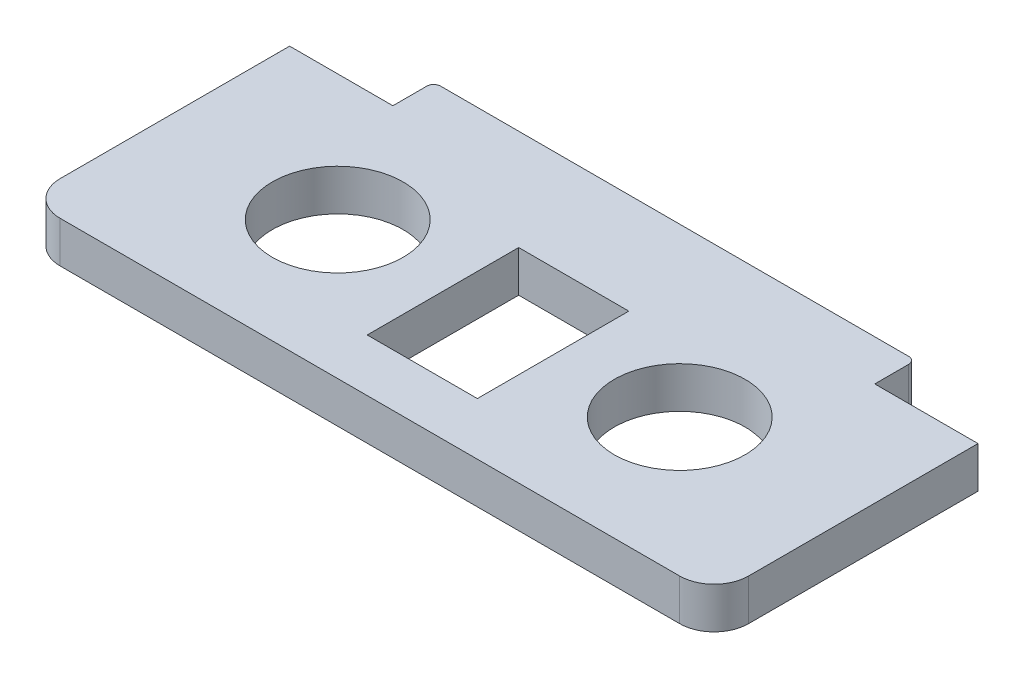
ISO-10303-21;
HEADER;
FILE_DESCRIPTION(('STEP AP214'),'2;1');
FILE_NAME('part.step','',(''),(''),'','','');
FILE_SCHEMA(('AUTOMOTIVE_DESIGN { 1 0 10303 214 1 1 1 1 }'));
ENDSEC;
DATA;
#1=APPLICATION_CONTEXT('core data for automotive mechanical design processes');
#2=APPLICATION_PROTOCOL_DEFINITION('international standard','automotive_design',2000,#1);
#3=PRODUCT_CONTEXT('',#1,'mechanical');
#4=PRODUCT('Part','Part','',(#3));
#5=PRODUCT_RELATED_PRODUCT_CATEGORY('part','',(#4));
#6=PRODUCT_DEFINITION_FORMATION('','',#4);
#7=PRODUCT_DEFINITION_CONTEXT('part definition',#1,'design');
#8=PRODUCT_DEFINITION('design','',#6,#7);
#9=PRODUCT_DEFINITION_SHAPE('','',#8);
#10=(LENGTH_UNIT() NAMED_UNIT(*) SI_UNIT(.MILLI.,.METRE.));
#11=(NAMED_UNIT(*) PLANE_ANGLE_UNIT() SI_UNIT($,.RADIAN.));
#12=(NAMED_UNIT(*) SI_UNIT($,.STERADIAN.) SOLID_ANGLE_UNIT());
#13=UNCERTAINTY_MEASURE_WITH_UNIT(LENGTH_MEASURE(1.E-05),#10,'distance_accuracy_value','');
#14=(GEOMETRIC_REPRESENTATION_CONTEXT(3) GLOBAL_UNCERTAINTY_ASSIGNED_CONTEXT((#13)) GLOBAL_UNIT_ASSIGNED_CONTEXT((#10,
#11,#12)) REPRESENTATION_CONTEXT('',''));
#15=CARTESIAN_POINT('',(0.,0.,0.));
#16=DIRECTION('',(0.,0.,1.));
#17=DIRECTION('',(1.,0.,0.));
#18=AXIS2_PLACEMENT_3D('',#15,#16,#17);
#19=CARTESIAN_POINT('',(0.,6.,0.));
#20=DIRECTION('',(0.,1.,0.));
#21=DIRECTION('',(0.,0.,1.));
#22=AXIS2_PLACEMENT_3D('',#19,#20,#21);
#23=PLANE('',#22);
#24=CARTESIAN_POINT('',(-24.68,6.,0.));
#25=DIRECTION('',(0.,1.,0.));
#26=DIRECTION('',(0.,0.,1.));
#27=AXIS2_PLACEMENT_3D('',#24,#25,#26);
#28=CIRCLE('',#27,9.5);
#29=CARTESIAN_POINT('',(-24.68,6.,9.5));
#30=VERTEX_POINT('',#29);
#31=EDGE_CURVE('E222',#30,#30,#28,.T.);
#32=ORIENTED_EDGE('',*,*,#31,.F.);
#33=EDGE_LOOP('',(#32));
#34=FACE_BOUND('',#33,.T.);
#35=DIRECTION('',(0.,0.,-1.));
#36=VECTOR('',#35,1.);
#37=CARTESIAN_POINT('',(35.,6.,-24.2659470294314));
#38=LINE('',#37,#36);
#39=CARTESIAN_POINT('',(35.,6.,-18.3320340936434));
#40=VERTEX_POINT('',#39);
#41=CARTESIAN_POINT('',(35.,6.,-23.2659470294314));
#42=VERTEX_POINT('',#41);
#43=EDGE_CURVE('E237',#40,#42,#38,.T.);
#44=ORIENTED_EDGE('',*,*,#43,.T.);
#45=CARTESIAN_POINT('',(34.,6.,-23.2659470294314));
#46=DIRECTION('',(0.,1.,0.));
#47=DIRECTION('',(0.,0.,1.));
#48=AXIS2_PLACEMENT_3D('',#45,#46,#47);
#49=CIRCLE('',#48,1.);
#50=CARTESIAN_POINT('',(34.,6.,-24.2659470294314));
#51=VERTEX_POINT('',#50);
#52=EDGE_CURVE('E52',#42,#51,#49,.T.);
#53=ORIENTED_EDGE('',*,*,#52,.T.);
#54=DIRECTION('',(-1.,0.,0.));
#55=VECTOR('',#54,1.);
#56=CARTESIAN_POINT('',(-35.,6.,-24.2659470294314));
#57=LINE('',#56,#55);
#58=CARTESIAN_POINT('',(-34.,6.,-24.2659470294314));
#59=VERTEX_POINT('',#58);
#60=EDGE_CURVE('E240',#51,#59,#57,.T.);
#61=ORIENTED_EDGE('',*,*,#60,.T.);
#62=CARTESIAN_POINT('',(-34.,6.,-23.2659470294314));
#63=DIRECTION('',(0.,1.,0.));
#64=DIRECTION('',(0.,0.,1.));
#65=AXIS2_PLACEMENT_3D('',#62,#63,#64);
#66=CIRCLE('',#65,1.);
#67=CARTESIAN_POINT('',(-35.,6.,-23.2659470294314));
#68=VERTEX_POINT('',#67);
#69=EDGE_CURVE('E59',#59,#68,#66,.T.);
#70=ORIENTED_EDGE('',*,*,#69,.T.);
#71=DIRECTION('',(0.,0.,1.));
#72=VECTOR('',#71,1.);
#73=CARTESIAN_POINT('',(-35.,6.,-18.3320340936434));
#74=LINE('',#73,#72);
#75=CARTESIAN_POINT('',(-35.,6.,-18.3320340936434));
#76=VERTEX_POINT('',#75);
#77=EDGE_CURVE('E243',#68,#76,#74,.T.);
#78=ORIENTED_EDGE('',*,*,#77,.T.);
#79=DIRECTION('',(-1.,0.,0.));
#80=VECTOR('',#79,1.);
#81=CARTESIAN_POINT('',(-50.,6.,-18.3320340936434));
#82=LINE('',#81,#80);
#83=CARTESIAN_POINT('',(-50.,6.,-18.3320340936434));
#84=VERTEX_POINT('',#83);
#85=EDGE_CURVE('E246',#76,#84,#82,.T.);
#86=ORIENTED_EDGE('',*,*,#85,.T.);
#87=DIRECTION('',(0.,0.,1.));
#88=VECTOR('',#87,1.);
#89=CARTESIAN_POINT('',(-50.,6.,-14.));
#90=LINE('',#89,#88);
#91=CARTESIAN_POINT('',(-50.,6.,15.));
#92=VERTEX_POINT('',#91);
#93=EDGE_CURVE('E249',#84,#92,#90,.T.);
#94=ORIENTED_EDGE('',*,*,#93,.T.);
#95=CARTESIAN_POINT('',(-45.,6.,15.));
#96=DIRECTION('',(0.,1.,0.));
#97=DIRECTION('',(0.,0.,1.));
#98=AXIS2_PLACEMENT_3D('',#95,#96,#97);
#99=CIRCLE('',#98,5.);
#100=CARTESIAN_POINT('',(-45.,6.,20.));
#101=VERTEX_POINT('',#100);
#102=EDGE_CURVE('E316',#92,#101,#99,.T.);
#103=ORIENTED_EDGE('',*,*,#102,.T.);
#104=DIRECTION('',(1.,0.,0.));
#105=VECTOR('',#104,1.);
#106=CARTESIAN_POINT('',(-50.,6.,20.));
#107=LINE('',#106,#105);
#108=CARTESIAN_POINT('',(45.,6.,20.));
#109=VERTEX_POINT('',#108);
#110=EDGE_CURVE('E253',#101,#109,#107,.T.);
#111=ORIENTED_EDGE('',*,*,#110,.T.);
#112=CARTESIAN_POINT('',(45.,6.,15.));
#113=DIRECTION('',(0.,1.,0.));
#114=DIRECTION('',(0.,0.,1.));
#115=AXIS2_PLACEMENT_3D('',#112,#113,#114);
#116=CIRCLE('',#115,5.);
#117=CARTESIAN_POINT('',(50.,6.,15.));
#118=VERTEX_POINT('',#117);
#119=EDGE_CURVE('E319',#109,#118,#116,.T.);
#120=ORIENTED_EDGE('',*,*,#119,.T.);
#121=DIRECTION('',(0.,0.,-1.));
#122=VECTOR('',#121,1.);
#123=CARTESIAN_POINT('',(50.,6.,-14.));
#124=LINE('',#123,#122);
#125=CARTESIAN_POINT('',(50.,6.,-18.3320340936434));
#126=VERTEX_POINT('',#125);
#127=EDGE_CURVE('E230',#118,#126,#124,.T.);
#128=ORIENTED_EDGE('',*,*,#127,.T.);
#129=DIRECTION('',(-1.,0.,0.));
#130=VECTOR('',#129,1.);
#131=CARTESIAN_POINT('',(35.,6.,-18.3320340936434));
#132=LINE('',#131,#130);
#133=EDGE_CURVE('E233',#126,#40,#132,.T.);
#134=ORIENTED_EDGE('',*,*,#133,.T.);
#135=EDGE_LOOP('',(#44,#53,#61,#70,#78,#86,#94,#103,#111,#120,#128,#134));
#136=FACE_BOUND('',#135,.T.);
#137=CARTESIAN_POINT('',(25.,6.,0.));
#138=DIRECTION('',(0.,1.,0.));
#139=DIRECTION('',(0.,0.,1.));
#140=AXIS2_PLACEMENT_3D('',#137,#138,#139);
#141=CIRCLE('',#140,9.5);
#142=CARTESIAN_POINT('',(25.,6.,9.5));
#143=VERTEX_POINT('',#142);
#144=EDGE_CURVE('E214',#143,#143,#141,.T.);
#145=ORIENTED_EDGE('',*,*,#144,.F.);
#146=EDGE_LOOP('',(#145));
#147=FACE_BOUND('',#146,.T.);
#148=DIRECTION('',(1.,0.,0.));
#149=VECTOR('',#148,1.);
#150=CARTESIAN_POINT('',(7.97828894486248,6.,12.3708315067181));
#151=LINE('',#150,#149);
#152=CARTESIAN_POINT('',(-8.02171105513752,6.,12.3708315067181));
#153=VERTEX_POINT('',#152);
#154=CARTESIAN_POINT('',(7.97828894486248,6.,12.3708315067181));
#155=VERTEX_POINT('',#154);
#156=EDGE_CURVE('E172',#153,#155,#151,.T.);
#157=ORIENTED_EDGE('',*,*,#156,.F.);
#158=DIRECTION('',(0.,0.,1.));
#159=VECTOR('',#158,1.);
#160=CARTESIAN_POINT('',(-8.02171105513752,6.,12.3708315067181));
#161=LINE('',#160,#159);
#162=CARTESIAN_POINT('',(-8.02171105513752,6.,-9.62916849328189));
#163=VERTEX_POINT('',#162);
#164=EDGE_CURVE('E161',#163,#153,#161,.T.);
#165=ORIENTED_EDGE('',*,*,#164,.F.);
#166=DIRECTION('',(-1.,0.,0.));
#167=VECTOR('',#166,1.);
#168=CARTESIAN_POINT('',(-8.02171105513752,6.,-9.62916849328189));
#169=LINE('',#168,#167);
#170=CARTESIAN_POINT('',(7.97828894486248,6.,-9.62916849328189));
#171=VERTEX_POINT('',#170);
#172=EDGE_CURVE('E190',#171,#163,#169,.T.);
#173=ORIENTED_EDGE('',*,*,#172,.F.);
#174=DIRECTION('',(0.,0.,-1.));
#175=VECTOR('',#174,1.);
#176=CARTESIAN_POINT('',(7.97828894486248,6.,-9.62916849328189));
#177=LINE('',#176,#175);
#178=EDGE_CURVE('E186',#155,#171,#177,.T.);
#179=ORIENTED_EDGE('',*,*,#178,.F.);
#180=EDGE_LOOP('',(#157,#165,#173,#179));
#181=FACE_BOUND('',#180,.T.);
#182=ADVANCED_FACE('F43',(#34,#136,#147,#181),#23,.T.);
#183=CARTESIAN_POINT('',(0.,0.,0.));
#184=DIRECTION('',(0.,1.,0.));
#185=DIRECTION('',(0.,0.,1.));
#186=AXIS2_PLACEMENT_3D('',#183,#184,#185);
#187=PLANE('',#186);
#188=CARTESIAN_POINT('',(25.,0.,0.));
#189=DIRECTION('',(0.,1.,0.));
#190=DIRECTION('',(0.,0.,1.));
#191=AXIS2_PLACEMENT_3D('',#188,#189,#190);
#192=CIRCLE('',#191,9.5);
#193=CARTESIAN_POINT('',(25.,0.,9.5));
#194=VERTEX_POINT('',#193);
#195=EDGE_CURVE('E181',#194,#194,#192,.T.);
#196=ORIENTED_EDGE('',*,*,#195,.T.);
#197=EDGE_LOOP('',(#196));
#198=FACE_BOUND('',#197,.T.);
#199=CARTESIAN_POINT('',(-24.68,0.,0.));
#200=DIRECTION('',(0.,1.,0.));
#201=DIRECTION('',(0.,0.,1.));
#202=AXIS2_PLACEMENT_3D('',#199,#200,#201);
#203=CIRCLE('',#202,9.5);
#204=CARTESIAN_POINT('',(-24.68,0.,9.5));
#205=VERTEX_POINT('',#204);
#206=EDGE_CURVE('E218',#205,#205,#203,.T.);
#207=ORIENTED_EDGE('',*,*,#206,.T.);
#208=EDGE_LOOP('',(#207));
#209=FACE_BOUND('',#208,.T.);
#210=DIRECTION('',(-1.,0.,0.));
#211=VECTOR('',#210,1.);
#212=CARTESIAN_POINT('',(-35.,0.,-24.2659470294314));
#213=LINE('',#212,#211);
#214=CARTESIAN_POINT('',(34.,0.,-24.2659470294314));
#215=VERTEX_POINT('',#214);
#216=CARTESIAN_POINT('',(-34.,0.,-24.2659470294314));
#217=VERTEX_POINT('',#216);
#218=EDGE_CURVE('E266',#215,#217,#213,.T.);
#219=ORIENTED_EDGE('',*,*,#218,.F.);
#220=CARTESIAN_POINT('',(34.,0.,-23.2659470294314));
#221=DIRECTION('',(0.,1.,0.));
#222=DIRECTION('',(0.,0.,1.));
#223=AXIS2_PLACEMENT_3D('',#220,#221,#222);
#224=CIRCLE('',#223,1.);
#225=CARTESIAN_POINT('',(35.,0.,-23.2659470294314));
#226=VERTEX_POINT('',#225);
#227=EDGE_CURVE('E335',#215,#226,#224,.F.);
#228=ORIENTED_EDGE('',*,*,#227,.T.);
#229=DIRECTION('',(0.,0.,-1.));
#230=VECTOR('',#229,1.);
#231=CARTESIAN_POINT('',(35.,0.,-24.2659470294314));
#232=LINE('',#231,#230);
#233=CARTESIAN_POINT('',(35.,0.,-18.3320340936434));
#234=VERTEX_POINT('',#233);
#235=EDGE_CURVE('E263',#234,#226,#232,.T.);
#236=ORIENTED_EDGE('',*,*,#235,.F.);
#237=DIRECTION('',(-1.,0.,0.));
#238=VECTOR('',#237,1.);
#239=CARTESIAN_POINT('',(35.,0.,-18.3320340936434));
#240=LINE('',#239,#238);
#241=CARTESIAN_POINT('',(50.,0.,-18.3320340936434));
#242=VERTEX_POINT('',#241);
#243=EDGE_CURVE('E260',#242,#234,#240,.T.);
#244=ORIENTED_EDGE('',*,*,#243,.F.);
#245=DIRECTION('',(0.,0.,-1.));
#246=VECTOR('',#245,1.);
#247=CARTESIAN_POINT('',(50.,0.,-18.3320340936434));
#248=LINE('',#247,#246);
#249=CARTESIAN_POINT('',(50.,0.,15.));
#250=VERTEX_POINT('',#249);
#251=EDGE_CURVE('E226',#250,#242,#248,.T.);
#252=ORIENTED_EDGE('',*,*,#251,.F.);
#253=CARTESIAN_POINT('',(45.,0.,15.));
#254=DIRECTION('',(0.,1.,0.));
#255=DIRECTION('',(0.,0.,1.));
#256=AXIS2_PLACEMENT_3D('',#253,#254,#255);
#257=CIRCLE('',#256,5.);
#258=CARTESIAN_POINT('',(45.,0.,20.));
#259=VERTEX_POINT('',#258);
#260=EDGE_CURVE('E306',#250,#259,#257,.F.);
#261=ORIENTED_EDGE('',*,*,#260,.T.);
#262=DIRECTION('',(1.,0.,0.));
#263=VECTOR('',#262,1.);
#264=CARTESIAN_POINT('',(-50.,0.,20.));
#265=LINE('',#264,#263);
#266=CARTESIAN_POINT('',(-45.,0.,20.));
#267=VERTEX_POINT('',#266);
#268=EDGE_CURVE('E234',#267,#259,#265,.T.);
#269=ORIENTED_EDGE('',*,*,#268,.F.);
#270=CARTESIAN_POINT('',(-45.,0.,15.));
#271=DIRECTION('',(0.,1.,0.));
#272=DIRECTION('',(0.,0.,1.));
#273=AXIS2_PLACEMENT_3D('',#270,#271,#272);
#274=CIRCLE('',#273,5.);
#275=CARTESIAN_POINT('',(-50.,0.,15.));
#276=VERTEX_POINT('',#275);
#277=EDGE_CURVE('E303',#267,#276,#274,.F.);
#278=ORIENTED_EDGE('',*,*,#277,.T.);
#279=DIRECTION('',(0.,0.,1.));
#280=VECTOR('',#279,1.);
#281=CARTESIAN_POINT('',(-50.,0.,-14.));
#282=LINE('',#281,#280);
#283=CARTESIAN_POINT('',(-50.,0.,-18.3320340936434));
#284=VERTEX_POINT('',#283);
#285=EDGE_CURVE('E277',#284,#276,#282,.T.);
#286=ORIENTED_EDGE('',*,*,#285,.F.);
#287=DIRECTION('',(-1.,0.,0.));
#288=VECTOR('',#287,1.);
#289=CARTESIAN_POINT('',(-50.,0.,-18.3320340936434));
#290=LINE('',#289,#288);
#291=CARTESIAN_POINT('',(-35.,0.,-18.3320340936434));
#292=VERTEX_POINT('',#291);
#293=EDGE_CURVE('E273',#292,#284,#290,.T.);
#294=ORIENTED_EDGE('',*,*,#293,.F.);
#295=DIRECTION('',(0.,0.,1.));
#296=VECTOR('',#295,1.);
#297=CARTESIAN_POINT('',(-35.,0.,-18.3320340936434));
#298=LINE('',#297,#296);
#299=CARTESIAN_POINT('',(-35.,0.,-23.2659470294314));
#300=VERTEX_POINT('',#299);
#301=EDGE_CURVE('E270',#300,#292,#298,.T.);
#302=ORIENTED_EDGE('',*,*,#301,.F.);
#303=CARTESIAN_POINT('',(-34.,0.,-23.2659470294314));
#304=DIRECTION('',(0.,1.,0.));
#305=DIRECTION('',(0.,0.,1.));
#306=AXIS2_PLACEMENT_3D('',#303,#304,#305);
#307=CIRCLE('',#306,1.);
#308=EDGE_CURVE('E332',#300,#217,#307,.F.);
#309=ORIENTED_EDGE('',*,*,#308,.T.);
#310=EDGE_LOOP('',(#219,#228,#236,#244,#252,#261,#269,#278,#286,#294,#302,#309));
#311=FACE_BOUND('',#310,.T.);
#312=DIRECTION('',(0.,0.,1.));
#313=VECTOR('',#312,1.);
#314=CARTESIAN_POINT('',(-8.02171105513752,0.,12.3708315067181));
#315=LINE('',#314,#313);
#316=CARTESIAN_POINT('',(-8.02171105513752,0.,-9.62916849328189));
#317=VERTEX_POINT('',#316);
#318=CARTESIAN_POINT('',(-8.02171105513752,0.,12.3708315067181));
#319=VERTEX_POINT('',#318);
#320=EDGE_CURVE('E195',#317,#319,#315,.T.);
#321=ORIENTED_EDGE('',*,*,#320,.T.);
#322=DIRECTION('',(1.,0.,0.));
#323=VECTOR('',#322,1.);
#324=CARTESIAN_POINT('',(7.97828894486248,0.,12.3708315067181));
#325=LINE('',#324,#323);
#326=CARTESIAN_POINT('',(7.97828894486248,0.,12.3708315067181));
#327=VERTEX_POINT('',#326);
#328=EDGE_CURVE('E179',#319,#327,#325,.T.);
#329=ORIENTED_EDGE('',*,*,#328,.T.);
#330=DIRECTION('',(0.,0.,-1.));
#331=VECTOR('',#330,1.);
#332=CARTESIAN_POINT('',(7.97828894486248,0.,-9.62916849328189));
#333=LINE('',#332,#331);
#334=CARTESIAN_POINT('',(7.97828894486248,0.,-9.62916849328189));
#335=VERTEX_POINT('',#334);
#336=EDGE_CURVE('E200',#327,#335,#333,.T.);
#337=ORIENTED_EDGE('',*,*,#336,.T.);
#338=DIRECTION('',(-1.,0.,0.));
#339=VECTOR('',#338,1.);
#340=CARTESIAN_POINT('',(-8.02171105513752,0.,-9.62916849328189));
#341=LINE('',#340,#339);
#342=EDGE_CURVE('E173',#335,#317,#341,.T.);
#343=ORIENTED_EDGE('',*,*,#342,.T.);
#344=EDGE_LOOP('',(#321,#329,#337,#343));
#345=FACE_BOUND('',#344,.T.);
#346=ADVANCED_FACE('F354',(#198,#209,#311,#345),#187,.F.);
#347=CARTESIAN_POINT('',(50.,6.,-18.3320340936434));
#348=DIRECTION('',(-1.,0.,0.));
#349=DIRECTION('',(0.,0.,1.));
#350=AXIS2_PLACEMENT_3D('',#347,#348,#349);
#351=PLANE('',#350);
#352=ORIENTED_EDGE('',*,*,#127,.F.);
#353=DIRECTION('',(0.,-1.,0.));
#354=VECTOR('',#353,1.);
#355=CARTESIAN_POINT('',(50.,6.,15.));
#356=LINE('',#355,#354);
#357=EDGE_CURVE('E299',#118,#250,#356,.T.);
#358=ORIENTED_EDGE('',*,*,#357,.T.);
#359=ORIENTED_EDGE('',*,*,#251,.T.);
#360=DIRECTION('',(0.,-1.,0.));
#361=VECTOR('',#360,1.);
#362=CARTESIAN_POINT('',(50.,6.,-18.3320340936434));
#363=LINE('',#362,#361);
#364=EDGE_CURVE('E295',#126,#242,#363,.T.);
#365=ORIENTED_EDGE('',*,*,#364,.F.);
#366=EDGE_LOOP('',(#352,#358,#359,#365));
#367=FACE_BOUND('',#366,.T.);
#368=ADVANCED_FACE('F367',(#367),#351,.F.);
#369=CARTESIAN_POINT('',(35.,6.,-18.3320340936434));
#370=DIRECTION('',(0.,0.,1.));
#371=DIRECTION('',(1.,0.,0.));
#372=AXIS2_PLACEMENT_3D('',#369,#370,#371);
#373=PLANE('',#372);
#374=ORIENTED_EDGE('',*,*,#243,.T.);
#375=DIRECTION('',(0.,-1.,0.));
#376=VECTOR('',#375,1.);
#377=CARTESIAN_POINT('',(35.,6.,-18.3320340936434));
#378=LINE('',#377,#376);
#379=EDGE_CURVE('E291',#40,#234,#378,.T.);
#380=ORIENTED_EDGE('',*,*,#379,.F.);
#381=ORIENTED_EDGE('',*,*,#133,.F.);
#382=ORIENTED_EDGE('',*,*,#364,.T.);
#383=EDGE_LOOP('',(#374,#380,#381,#382));
#384=FACE_BOUND('',#383,.T.);
#385=ADVANCED_FACE('F361',(#384),#373,.F.);
#386=CARTESIAN_POINT('',(35.,6.,-24.2659470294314));
#387=DIRECTION('',(-1.,0.,0.));
#388=DIRECTION('',(0.,0.,1.));
#389=AXIS2_PLACEMENT_3D('',#386,#387,#388);
#390=PLANE('',#389);
#391=ORIENTED_EDGE('',*,*,#235,.T.);
#392=DIRECTION('',(0.,-1.,0.));
#393=VECTOR('',#392,1.);
#394=CARTESIAN_POINT('',(35.,6.,-23.2659470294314));
#395=LINE('',#394,#393);
#396=EDGE_CURVE('E67',#226,#42,#395,.F.);
#397=ORIENTED_EDGE('',*,*,#396,.T.);
#398=ORIENTED_EDGE('',*,*,#43,.F.);
#399=ORIENTED_EDGE('',*,*,#379,.T.);
#400=EDGE_LOOP('',(#391,#397,#398,#399));
#401=FACE_BOUND('',#400,.T.);
#402=ADVANCED_FACE('F357',(#401),#390,.F.);
#403=CARTESIAN_POINT('',(-35.,6.,-24.2659470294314));
#404=DIRECTION('',(0.,0.,1.));
#405=DIRECTION('',(1.,0.,0.));
#406=AXIS2_PLACEMENT_3D('',#403,#404,#405);
#407=PLANE('',#406);
#408=ORIENTED_EDGE('',*,*,#60,.F.);
#409=DIRECTION('',(0.,-1.,0.));
#410=VECTOR('',#409,1.);
#411=CARTESIAN_POINT('',(34.,6.,-24.2659470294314));
#412=LINE('',#411,#410);
#413=EDGE_CURVE('E328',#51,#215,#412,.T.);
#414=ORIENTED_EDGE('',*,*,#413,.T.);
#415=ORIENTED_EDGE('',*,*,#218,.T.);
#416=DIRECTION('',(0.,-1.,0.));
#417=VECTOR('',#416,1.);
#418=CARTESIAN_POINT('',(-34.,6.,-24.2659470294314));
#419=LINE('',#418,#417);
#420=EDGE_CURVE('E325',#217,#59,#419,.F.);
#421=ORIENTED_EDGE('',*,*,#420,.T.);
#422=EDGE_LOOP('',(#408,#414,#415,#421));
#423=FACE_BOUND('',#422,.T.);
#424=ADVANCED_FACE('F348',(#423),#407,.F.);
#425=CARTESIAN_POINT('',(-35.,6.,-18.3320340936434));
#426=DIRECTION('',(1.,0.,0.));
#427=DIRECTION('',(0.,0.,-1.));
#428=AXIS2_PLACEMENT_3D('',#425,#426,#427);
#429=PLANE('',#428);
#430=ORIENTED_EDGE('',*,*,#77,.F.);
#431=DIRECTION('',(0.,-1.,0.));
#432=VECTOR('',#431,1.);
#433=CARTESIAN_POINT('',(-35.,6.,-23.2659470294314));
#434=LINE('',#433,#432);
#435=EDGE_CURVE('E11',#68,#300,#434,.T.);
#436=ORIENTED_EDGE('',*,*,#435,.T.);
#437=ORIENTED_EDGE('',*,*,#301,.T.);
#438=DIRECTION('',(0.,-1.,0.));
#439=VECTOR('',#438,1.);
#440=CARTESIAN_POINT('',(-35.,6.,-18.3320340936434));
#441=LINE('',#440,#439);
#442=EDGE_CURVE('E287',#76,#292,#441,.T.);
#443=ORIENTED_EDGE('',*,*,#442,.F.);
#444=EDGE_LOOP('',(#430,#436,#437,#443));
#445=FACE_BOUND('',#444,.T.);
#446=ADVANCED_FACE('F392',(#445),#429,.F.);
#447=CARTESIAN_POINT('',(-50.,6.,-18.3320340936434));
#448=DIRECTION('',(0.,0.,1.));
#449=DIRECTION('',(1.,0.,0.));
#450=AXIS2_PLACEMENT_3D('',#447,#448,#449);
#451=PLANE('',#450);
#452=ORIENTED_EDGE('',*,*,#293,.T.);
#453=DIRECTION('',(0.,-1.,0.));
#454=VECTOR('',#453,1.);
#455=CARTESIAN_POINT('',(-50.,6.,-18.3320340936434));
#456=LINE('',#455,#454);
#457=EDGE_CURVE('E257',#84,#284,#456,.T.);
#458=ORIENTED_EDGE('',*,*,#457,.F.);
#459=ORIENTED_EDGE('',*,*,#85,.F.);
#460=ORIENTED_EDGE('',*,*,#442,.T.);
#461=EDGE_LOOP('',(#452,#458,#459,#460));
#462=FACE_BOUND('',#461,.T.);
#463=ADVANCED_FACE('F388',(#462),#451,.F.);
#464=CARTESIAN_POINT('',(-50.,6.,-14.));
#465=DIRECTION('',(1.,0.,0.));
#466=DIRECTION('',(0.,0.,-1.));
#467=AXIS2_PLACEMENT_3D('',#464,#465,#466);
#468=PLANE('',#467);
#469=ORIENTED_EDGE('',*,*,#285,.T.);
#470=DIRECTION('',(0.,-1.,0.));
#471=VECTOR('',#470,1.);
#472=CARTESIAN_POINT('',(-50.,6.,15.));
#473=LINE('',#472,#471);
#474=EDGE_CURVE('E322',#276,#92,#473,.F.);
#475=ORIENTED_EDGE('',*,*,#474,.T.);
#476=ORIENTED_EDGE('',*,*,#93,.F.);
#477=ORIENTED_EDGE('',*,*,#457,.T.);
#478=EDGE_LOOP('',(#469,#475,#476,#477));
#479=FACE_BOUND('',#478,.T.);
#480=ADVANCED_FACE('F384',(#479),#468,.F.);
#481=CARTESIAN_POINT('',(-50.,6.,20.));
#482=DIRECTION('',(0.,0.,-1.));
#483=DIRECTION('',(-1.,0.,0.));
#484=AXIS2_PLACEMENT_3D('',#481,#482,#483);
#485=PLANE('',#484);
#486=ORIENTED_EDGE('',*,*,#268,.T.);
#487=DIRECTION('',(0.,-1.,0.));
#488=VECTOR('',#487,1.);
#489=CARTESIAN_POINT('',(45.,6.,20.));
#490=LINE('',#489,#488);
#491=EDGE_CURVE('E313',#259,#109,#490,.F.);
#492=ORIENTED_EDGE('',*,*,#491,.T.);
#493=ORIENTED_EDGE('',*,*,#110,.F.);
#494=DIRECTION('',(0.,-1.,0.));
#495=VECTOR('',#494,1.);
#496=CARTESIAN_POINT('',(-45.,6.,20.));
#497=LINE('',#496,#495);
#498=EDGE_CURVE('E309',#101,#267,#497,.T.);
#499=ORIENTED_EDGE('',*,*,#498,.T.);
#500=EDGE_LOOP('',(#486,#492,#493,#499));
#501=FACE_BOUND('',#500,.T.);
#502=ADVANCED_FACE('F375',(#501),#485,.F.);
#503=CARTESIAN_POINT('',(-24.68,6.,0.));
#504=DIRECTION('',(0.,-1.,0.));
#505=DIRECTION('',(0.,0.,-1.));
#506=AXIS2_PLACEMENT_3D('',#503,#504,#505);
#507=CYLINDRICAL_SURFACE('',#506,9.5);
#508=ORIENTED_EDGE('',*,*,#31,.T.);
#509=EDGE_LOOP('',(#508));
#510=FACE_BOUND('',#509,.T.);
#511=ORIENTED_EDGE('',*,*,#206,.F.);
#512=EDGE_LOOP('',(#511));
#513=FACE_BOUND('',#512,.T.);
#514=ADVANCED_FACE('F409',(#510,#513),#507,.F.);
#515=CARTESIAN_POINT('',(25.,6.,0.));
#516=DIRECTION('',(0.,-1.,0.));
#517=DIRECTION('',(0.,0.,-1.));
#518=AXIS2_PLACEMENT_3D('',#515,#516,#517);
#519=CYLINDRICAL_SURFACE('',#518,9.5);
#520=ORIENTED_EDGE('',*,*,#144,.T.);
#521=EDGE_LOOP('',(#520));
#522=FACE_BOUND('',#521,.T.);
#523=ORIENTED_EDGE('',*,*,#195,.F.);
#524=EDGE_LOOP('',(#523));
#525=FACE_BOUND('',#524,.T.);
#526=ADVANCED_FACE('F497',(#522,#525),#519,.F.);
#527=CARTESIAN_POINT('',(-8.02171105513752,6.,12.3708315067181));
#528=DIRECTION('',(1.,0.,0.));
#529=DIRECTION('',(0.,0.,-1.));
#530=AXIS2_PLACEMENT_3D('',#527,#528,#529);
#531=PLANE('',#530);
#532=ORIENTED_EDGE('',*,*,#320,.F.);
#533=DIRECTION('',(0.,-1.,0.));
#534=VECTOR('',#533,1.);
#535=CARTESIAN_POINT('',(-8.02171105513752,6.,-9.62916849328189));
#536=LINE('',#535,#534);
#537=EDGE_CURVE('E167',#163,#317,#536,.T.);
#538=ORIENTED_EDGE('',*,*,#537,.F.);
#539=ORIENTED_EDGE('',*,*,#164,.T.);
#540=DIRECTION('',(0.,-1.,0.));
#541=VECTOR('',#540,1.);
#542=CARTESIAN_POINT('',(-8.02171105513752,6.,12.3708315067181));
#543=LINE('',#542,#541);
#544=EDGE_CURVE('E164',#153,#319,#543,.T.);
#545=ORIENTED_EDGE('',*,*,#544,.T.);
#546=EDGE_LOOP('',(#532,#538,#539,#545));
#547=FACE_BOUND('',#546,.T.);
#548=ADVANCED_FACE('F163',(#547),#531,.T.);
#549=CARTESIAN_POINT('',(7.97828894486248,6.,12.3708315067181));
#550=DIRECTION('',(0.,0.,-1.));
#551=DIRECTION('',(-1.,0.,0.));
#552=AXIS2_PLACEMENT_3D('',#549,#550,#551);
#553=PLANE('',#552);
#554=ORIENTED_EDGE('',*,*,#328,.F.);
#555=ORIENTED_EDGE('',*,*,#544,.F.);
#556=ORIENTED_EDGE('',*,*,#156,.T.);
#557=DIRECTION('',(0.,-1.,0.));
#558=VECTOR('',#557,1.);
#559=CARTESIAN_POINT('',(7.97828894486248,6.,12.3708315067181));
#560=LINE('',#559,#558);
#561=EDGE_CURVE('E182',#155,#327,#560,.T.);
#562=ORIENTED_EDGE('',*,*,#561,.T.);
#563=EDGE_LOOP('',(#554,#555,#556,#562));
#564=FACE_BOUND('',#563,.T.);
#565=ADVANCED_FACE('F176',(#564),#553,.T.);
#566=CARTESIAN_POINT('',(7.97828894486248,6.,-9.62916849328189));
#567=DIRECTION('',(-1.,0.,0.));
#568=DIRECTION('',(0.,0.,1.));
#569=AXIS2_PLACEMENT_3D('',#566,#567,#568);
#570=PLANE('',#569);
#571=ORIENTED_EDGE('',*,*,#336,.F.);
#572=ORIENTED_EDGE('',*,*,#561,.F.);
#573=ORIENTED_EDGE('',*,*,#178,.T.);
#574=DIRECTION('',(0.,-1.,0.));
#575=VECTOR('',#574,1.);
#576=CARTESIAN_POINT('',(7.97828894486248,6.,-9.62916849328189));
#577=LINE('',#576,#575);
#578=EDGE_CURVE('E209',#171,#335,#577,.T.);
#579=ORIENTED_EDGE('',*,*,#578,.T.);
#580=EDGE_LOOP('',(#571,#572,#573,#579));
#581=FACE_BOUND('',#580,.T.);
#582=ADVANCED_FACE('F470',(#581),#570,.T.);
#583=CARTESIAN_POINT('',(-8.02171105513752,6.,-9.62916849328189));
#584=DIRECTION('',(0.,0.,1.));
#585=DIRECTION('',(1.,0.,0.));
#586=AXIS2_PLACEMENT_3D('',#583,#584,#585);
#587=PLANE('',#586);
#588=ORIENTED_EDGE('',*,*,#342,.F.);
#589=ORIENTED_EDGE('',*,*,#578,.F.);
#590=ORIENTED_EDGE('',*,*,#172,.T.);
#591=ORIENTED_EDGE('',*,*,#537,.T.);
#592=EDGE_LOOP('',(#588,#589,#590,#591));
#593=FACE_BOUND('',#592,.T.);
#594=ADVANCED_FACE('F430',(#593),#587,.T.);
#595=CARTESIAN_POINT('',(45.,6.,15.));
#596=DIRECTION('',(0.,-1.,0.));
#597=DIRECTION('',(0.,0.,-1.));
#598=AXIS2_PLACEMENT_3D('',#595,#596,#597);
#599=CYLINDRICAL_SURFACE('',#598,5.);
#600=ORIENTED_EDGE('',*,*,#119,.F.);
#601=ORIENTED_EDGE('',*,*,#491,.F.);
#602=ORIENTED_EDGE('',*,*,#260,.F.);
#603=ORIENTED_EDGE('',*,*,#357,.F.);
#604=EDGE_LOOP('',(#600,#601,#602,#603));
#605=FACE_BOUND('',#604,.T.);
#606=ADVANCED_FACE('F371',(#605),#599,.T.);
#607=CARTESIAN_POINT('',(-45.,6.,15.));
#608=DIRECTION('',(0.,-1.,0.));
#609=DIRECTION('',(0.,0.,-1.));
#610=AXIS2_PLACEMENT_3D('',#607,#608,#609);
#611=CYLINDRICAL_SURFACE('',#610,5.);
#612=ORIENTED_EDGE('',*,*,#102,.F.);
#613=ORIENTED_EDGE('',*,*,#474,.F.);
#614=ORIENTED_EDGE('',*,*,#277,.F.);
#615=ORIENTED_EDGE('',*,*,#498,.F.);
#616=EDGE_LOOP('',(#612,#613,#614,#615));
#617=FACE_BOUND('',#616,.T.);
#618=ADVANCED_FACE('F381',(#617),#611,.T.);
#619=CARTESIAN_POINT('',(34.,6.,-23.2659470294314));
#620=DIRECTION('',(0.,-1.,0.));
#621=DIRECTION('',(0.,0.,-1.));
#622=AXIS2_PLACEMENT_3D('',#619,#620,#621);
#623=CYLINDRICAL_SURFACE('',#622,1.);
#624=ORIENTED_EDGE('',*,*,#52,.F.);
#625=ORIENTED_EDGE('',*,*,#396,.F.);
#626=ORIENTED_EDGE('',*,*,#227,.F.);
#627=ORIENTED_EDGE('',*,*,#413,.F.);
#628=EDGE_LOOP('',(#624,#625,#626,#627));
#629=FACE_BOUND('',#628,.T.);
#630=ADVANCED_FACE('F351',(#629),#623,.T.);
#631=CARTESIAN_POINT('',(-34.,6.,-23.2659470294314));
#632=DIRECTION('',(0.,-1.,0.));
#633=DIRECTION('',(0.,0.,-1.));
#634=AXIS2_PLACEMENT_3D('',#631,#632,#633);
#635=CYLINDRICAL_SURFACE('',#634,1.);
#636=ORIENTED_EDGE('',*,*,#69,.F.);
#637=ORIENTED_EDGE('',*,*,#420,.F.);
#638=ORIENTED_EDGE('',*,*,#308,.F.);
#639=ORIENTED_EDGE('',*,*,#435,.F.);
#640=EDGE_LOOP('',(#636,#637,#638,#639));
#641=FACE_BOUND('',#640,.T.);
#642=ADVANCED_FACE('F45',(#641),#635,.T.);
#643=CLOSED_SHELL('',(#182,#346,#368,#385,#402,#424,#446,#463,#480,#502,#514,#526,#548,#565,
#582,#594,#606,#618,#630,#642));
#644=MANIFOLD_SOLID_BREP('B2',#643);
#645=ADVANCED_BREP_SHAPE_REPRESENTATION('',(#18,#644),#14);
#646=SHAPE_DEFINITION_REPRESENTATION(#9,#645);
ENDSEC;
END-ISO-10303-21;
